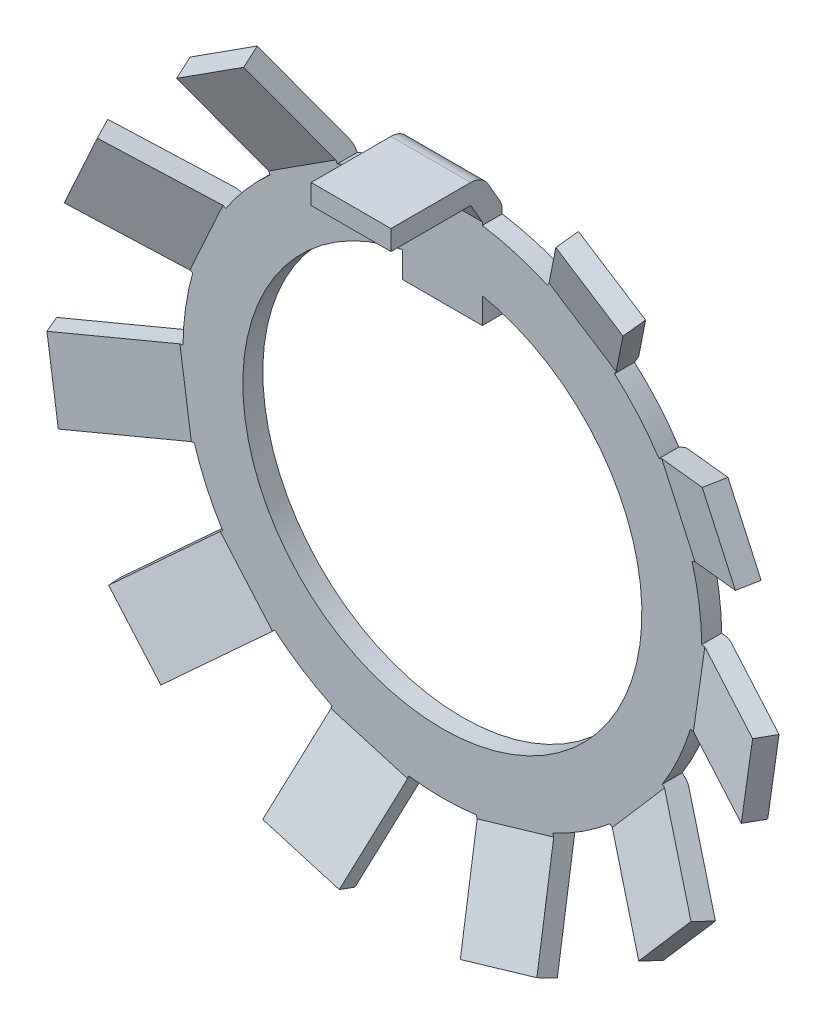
from build123d import *

# Parameters (mm, degrees)
ESQUISSE1_R                  = 13
BASE_EXTRUSION_DEPTH         = 1
BOSS_EXTRU_MINCE1_DEPTH      = 2
R_P_TITION_CIRCULAIRE1_COUNT = 10
R_P_TITION_CIRCULAIRE1_ANGLE = 294.545454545
BOSS_EXTRU_MINCE2_DEPTH      = 2


with BuildPart() as part:
    # Esquisse1 → Base-Extrusion (new body)
    with BuildSketch(Plane.XY):
        Circle(ESQUISSE1_R)
        with BuildLine():
            Line((-2, 8.5), (2, 8.5))
            Line((2, 8.5), (2, 9.797958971))
            ThreePointArc((2, 9.797958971), (0, -10), (-2, 9.797958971))
            Line((-2, 9.797958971), (-2, 8.5))
        make_face(mode=Mode.SUBTRACT)
    extrude(amount=BASE_EXTRUSION_DEPTH)

    # Esquisse2 → Boss.-Extru.-Mince1 (add, symmetric)
    with BuildSketch(Plane(origin=(0, 0, 0), x_dir=(-0.5406408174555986, 0.8412535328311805, 0), z_dir=(0.8412535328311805, 0.5406408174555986, 0))):
        with BuildLine():
            Line((10, 0), (13, 0))
            ThreePointArc((13, 0), (13.216439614, 0.023703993), (13.422618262, 0.093692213))
            Line((13.422618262, 0.093692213), (18, 2.228160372))
            Line((18, 2.228160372), (17.577381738, 3.134468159))
            Line((17.577381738, 3.134468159), (13, 1))
            Line((13, 1), (10, 1))
            Line((10, 1), (10, 0))
        make_face()
    boss_extru_mince1 = extrude(amount=BOSS_EXTRU_MINCE1_DEPTH, both=True)

    # R_p_tition circulaire1: Boss.-Extru.-Mince1 ×10 about axis
    r_p_tition_circulaire1_axis = Axis((0, 0, -7.805907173), (0, 0, 1))
    for i in range(1, R_P_TITION_CIRCULAIRE1_COUNT):
        add(boss_extru_mince1.rotate(r_p_tition_circulaire1_axis, i * R_P_TITION_CIRCULAIRE1_ANGLE / (R_P_TITION_CIRCULAIRE1_COUNT - 1)))

    # Esquisse3 → Boss.-Extru.-Mince2 (add, symmetric)
    with BuildSketch(Plane(origin=(0, 0, 0), x_dir=(0, 0, -1), z_dir=(1, 0, 0))):
        with BuildLine():
            Line((0, 10), (0, 13))
            ThreePointArc((0, 13), (-0.034074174, 13.258819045), (-0.133974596, 13.5))
            Line((-0.133974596, 13.5), (-0.711324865, 14.5))
            ThreePointArc((-0.711324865, 14.5), (-1.077350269, 14.866025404), (-1.577350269, 15))
            Line((-1.577350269, 15), (-5.577350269, 15))
            Line((-5.577350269, 15), (-5.577350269, 14))
            Line((-5.577350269, 14), (-1.577350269, 14))
            Line((-1.577350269, 14), (-1, 13))
            Line((-1, 13), (-1, 10))
            Line((-1, 10), (0, 10))
        make_face()
    extrude(amount=BOSS_EXTRU_MINCE2_DEPTH, both=True)


solid = part.part
